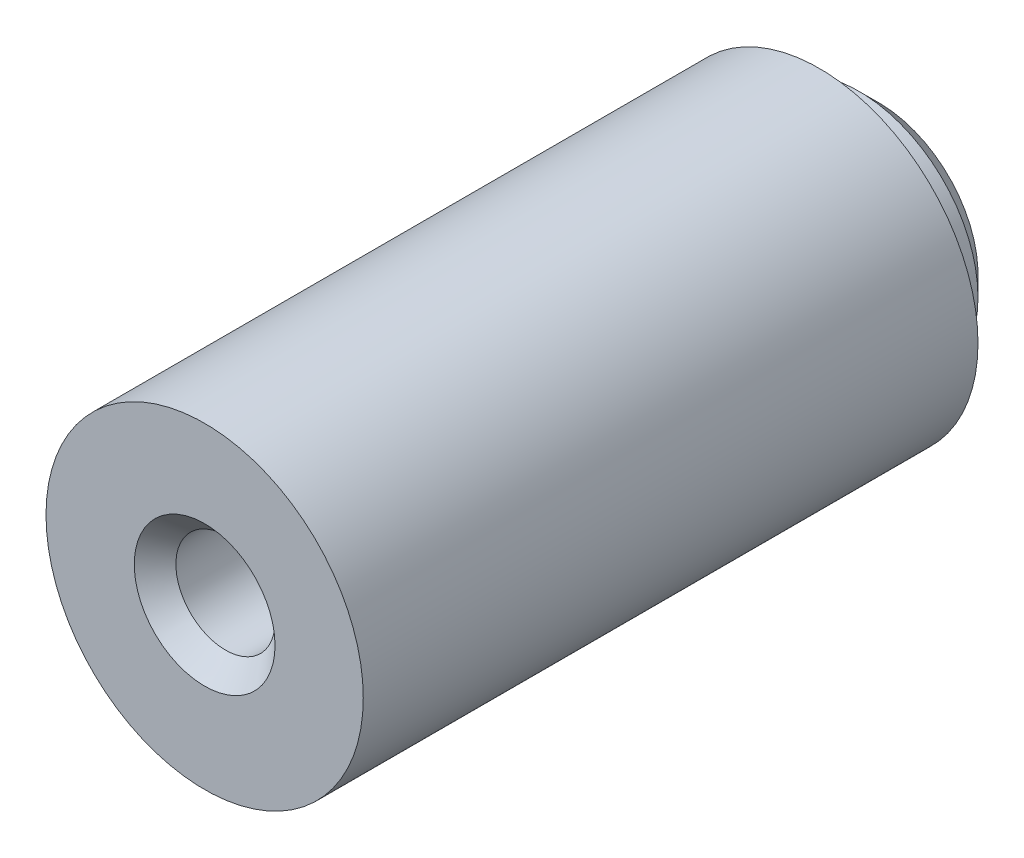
ISO-10303-21;
HEADER;
FILE_DESCRIPTION(('STEP AP214'),'2;1');
FILE_NAME('part.step','',(''),(''),'','','');
FILE_SCHEMA(('AUTOMOTIVE_DESIGN { 1 0 10303 214 1 1 1 1 }'));
ENDSEC;
DATA;
#1=APPLICATION_CONTEXT('core data for automotive mechanical design processes');
#2=APPLICATION_PROTOCOL_DEFINITION('international standard','automotive_design',2000,#1);
#3=PRODUCT_CONTEXT('',#1,'mechanical');
#4=PRODUCT('Part','Part','',(#3));
#5=PRODUCT_RELATED_PRODUCT_CATEGORY('part','',(#4));
#6=PRODUCT_DEFINITION_FORMATION('','',#4);
#7=PRODUCT_DEFINITION_CONTEXT('part definition',#1,'design');
#8=PRODUCT_DEFINITION('design','',#6,#7);
#9=PRODUCT_DEFINITION_SHAPE('','',#8);
#10=(LENGTH_UNIT() NAMED_UNIT(*) SI_UNIT(.MILLI.,.METRE.));
#11=(NAMED_UNIT(*) PLANE_ANGLE_UNIT() SI_UNIT($,.RADIAN.));
#12=(NAMED_UNIT(*) SI_UNIT($,.STERADIAN.) SOLID_ANGLE_UNIT());
#13=UNCERTAINTY_MEASURE_WITH_UNIT(LENGTH_MEASURE(1.E-05),#10,'distance_accuracy_value','');
#14=(GEOMETRIC_REPRESENTATION_CONTEXT(3) GLOBAL_UNCERTAINTY_ASSIGNED_CONTEXT((#13)) GLOBAL_UNIT_ASSIGNED_CONTEXT((#10,
#11,#12)) REPRESENTATION_CONTEXT('',''));
#15=CARTESIAN_POINT('',(0.,0.,0.));
#16=DIRECTION('',(0.,0.,1.));
#17=DIRECTION('',(1.,0.,0.));
#18=AXIS2_PLACEMENT_3D('',#15,#16,#17);
#19=CARTESIAN_POINT('',(0.,0.,0.));
#20=DIRECTION('',(0.,0.,1.));
#21=DIRECTION('',(1.,0.,0.));
#22=AXIS2_PLACEMENT_3D('',#19,#20,#21);
#23=PLANE('',#22);
#24=CARTESIAN_POINT('',(0.,0.,0.));
#25=DIRECTION('',(0.,0.,1.));
#26=DIRECTION('',(1.,0.,0.));
#27=AXIS2_PLACEMENT_3D('',#24,#25,#26);
#28=CIRCLE('',#27,4.);
#29=CARTESIAN_POINT('',(4.,0.,0.));
#30=VERTEX_POINT('',#29);
#31=EDGE_CURVE('E58',#30,#30,#28,.T.);
#32=ORIENTED_EDGE('',*,*,#31,.F.);
#33=EDGE_LOOP('',(#32));
#34=FACE_BOUND('',#33,.T.);
#35=CARTESIAN_POINT('',(0.,0.,0.));
#36=DIRECTION('',(0.,0.,1.));
#37=DIRECTION('',(1.,0.,0.));
#38=AXIS2_PLACEMENT_3D('',#35,#36,#37);
#39=CIRCLE('',#38,3.);
#40=CARTESIAN_POINT('',(3.,0.,0.));
#41=VERTEX_POINT('',#40);
#42=EDGE_CURVE('E70',#41,#41,#39,.F.);
#43=ORIENTED_EDGE('',*,*,#42,.F.);
#44=EDGE_LOOP('',(#43));
#45=FACE_BOUND('',#44,.T.);
#46=ADVANCED_FACE('F38',(#34,#45),#23,.F.);
#47=CARTESIAN_POINT('',(0.,0.,15.5));
#48=DIRECTION('',(0.,0.,-1.));
#49=DIRECTION('',(-1.,0.,0.));
#50=AXIS2_PLACEMENT_3D('',#47,#48,#49);
#51=CYLINDRICAL_SURFACE('',#50,4.);
#52=CARTESIAN_POINT('',(0.,0.,15.5));
#53=DIRECTION('',(0.,0.,1.));
#54=DIRECTION('',(1.,0.,0.));
#55=AXIS2_PLACEMENT_3D('',#52,#53,#54);
#56=CIRCLE('',#55,4.);
#57=CARTESIAN_POINT('',(4.,0.,15.5));
#58=VERTEX_POINT('',#57);
#59=EDGE_CURVE('E62',#58,#58,#56,.T.);
#60=ORIENTED_EDGE('',*,*,#59,.F.);
#61=EDGE_LOOP('',(#60));
#62=FACE_BOUND('',#61,.T.);
#63=ORIENTED_EDGE('',*,*,#31,.T.);
#64=EDGE_LOOP('',(#63));
#65=FACE_BOUND('',#64,.T.);
#66=ADVANCED_FACE('F87',(#62,#65),#51,.T.);
#67=CARTESIAN_POINT('',(0.,0.,15.5));
#68=DIRECTION('',(0.,0.,1.));
#69=DIRECTION('',(1.,0.,0.));
#70=AXIS2_PLACEMENT_3D('',#67,#68,#69);
#71=PLANE('',#70);
#72=CARTESIAN_POINT('',(0.000299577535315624,0.0346153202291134,15.5));
#73=DIRECTION('',(0.,0.,1.));
#74=DIRECTION('',(1.,0.,0.));
#75=AXIS2_PLACEMENT_3D('',#72,#73,#74);
#76=CIRCLE('',#75,1.775);
#77=CARTESIAN_POINT('',(1.77529957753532,0.0346153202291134,15.5));
#78=VERTEX_POINT('',#77);
#79=EDGE_CURVE('E65',#78,#78,#76,.T.);
#80=ORIENTED_EDGE('',*,*,#79,.F.);
#81=EDGE_LOOP('',(#80));
#82=FACE_BOUND('',#81,.T.);
#83=ORIENTED_EDGE('',*,*,#59,.T.);
#84=EDGE_LOOP('',(#83));
#85=FACE_BOUND('',#84,.T.);
#86=ADVANCED_FACE('F52',(#82,#85),#71,.T.);
#87=CARTESIAN_POINT('',(0.000299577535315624,0.0346153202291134,3.));
#88=DIRECTION('',(0.,0.,1.));
#89=DIRECTION('',(1.,0.,0.));
#90=AXIS2_PLACEMENT_3D('',#87,#88,#89);
#91=CONICAL_SURFACE('',#90,1.25,1.02974425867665);
#92=CARTESIAN_POINT('',(0.000299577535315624,0.0346153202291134,2.24892422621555));
#93=VERTEX_POINT('',#92);
#94=VERTEX_LOOP('',#93);
#95=FACE_BOUND('',#94,.T.);
#96=CARTESIAN_POINT('',(0.000299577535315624,0.0346153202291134,3.));
#97=DIRECTION('',(0.,0.,1.));
#98=DIRECTION('',(1.,0.,0.));
#99=AXIS2_PLACEMENT_3D('',#96,#97,#98);
#100=CIRCLE('',#99,1.25);
#101=CARTESIAN_POINT('',(1.25029957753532,0.0346153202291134,3.));
#102=VERTEX_POINT('',#101);
#103=EDGE_CURVE('E56',#102,#102,#100,.T.);
#104=ORIENTED_EDGE('',*,*,#103,.T.);
#105=EDGE_LOOP('',(#104));
#106=FACE_BOUND('',#105,.T.);
#107=ADVANCED_FACE('F48',(#95,#106),#91,.F.);
#108=CARTESIAN_POINT('',(0.000299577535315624,0.0346153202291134,15.5));
#109=DIRECTION('',(0.,0.,1.));
#110=DIRECTION('',(1.,0.,0.));
#111=AXIS2_PLACEMENT_3D('',#108,#109,#110);
#112=CYLINDRICAL_SURFACE('',#111,1.25);
#113=ORIENTED_EDGE('',*,*,#103,.F.);
#114=EDGE_LOOP('',(#113));
#115=FACE_BOUND('',#114,.T.);
#116=CARTESIAN_POINT('',(0.000299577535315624,0.0346153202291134,14.9750000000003));
#117=DIRECTION('',(0.,0.,1.));
#118=DIRECTION('',(1.,0.,0.));
#119=AXIS2_PLACEMENT_3D('',#116,#117,#118);
#120=CIRCLE('',#119,1.25);
#121=CARTESIAN_POINT('',(1.25029957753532,0.0346153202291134,14.9750000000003));
#122=VERTEX_POINT('',#121);
#123=EDGE_CURVE('E59',#122,#122,#120,.T.);
#124=ORIENTED_EDGE('',*,*,#123,.T.);
#125=EDGE_LOOP('',(#124));
#126=FACE_BOUND('',#125,.T.);
#127=ADVANCED_FACE('F51',(#115,#126),#112,.F.);
#128=CARTESIAN_POINT('',(0.000299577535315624,0.0346153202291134,15.5));
#129=DIRECTION('',(0.,0.,1.));
#130=DIRECTION('',(1.,0.,0.));
#131=AXIS2_PLACEMENT_3D('',#128,#129,#130);
#132=CONICAL_SURFACE('',#131,1.775,0.785398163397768);
#133=ORIENTED_EDGE('',*,*,#123,.F.);
#134=EDGE_LOOP('',(#133));
#135=FACE_BOUND('',#134,.T.);
#136=ORIENTED_EDGE('',*,*,#79,.T.);
#137=EDGE_LOOP('',(#136));
#138=FACE_BOUND('',#137,.T.);
#139=ADVANCED_FACE('F102',(#135,#138),#132,.F.);
#140=CARTESIAN_POINT('',(0.,0.,-1.5));
#141=DIRECTION('',(0.,0.,1.));
#142=DIRECTION('',(1.,0.,0.));
#143=AXIS2_PLACEMENT_3D('',#140,#141,#142);
#144=CYLINDRICAL_SURFACE('',#143,3.);
#145=CARTESIAN_POINT('',(0.,0.,-1.));
#146=DIRECTION('',(0.,0.,-1.));
#147=DIRECTION('',(-1.,0.,0.));
#148=AXIS2_PLACEMENT_3D('',#145,#146,#147);
#149=CIRCLE('',#148,3.);
#150=CARTESIAN_POINT('',(-3.,0.,-1.));
#151=VERTEX_POINT('',#150);
#152=EDGE_CURVE('E11',#151,#151,#149,.F.);
#153=ORIENTED_EDGE('',*,*,#152,.T.);
#154=EDGE_LOOP('',(#153));
#155=FACE_BOUND('',#154,.T.);
#156=ORIENTED_EDGE('',*,*,#42,.T.);
#157=EDGE_LOOP('',(#156));
#158=FACE_BOUND('',#157,.T.);
#159=ADVANCED_FACE('F83',(#155,#158),#144,.T.);
#160=CARTESIAN_POINT('',(0.,0.,-1.5));
#161=DIRECTION('',(0.,0.,-1.));
#162=DIRECTION('',(-1.,0.,0.));
#163=AXIS2_PLACEMENT_3D('',#160,#161,#162);
#164=PLANE('',#163);
#165=CARTESIAN_POINT('',(0.,0.,-1.5));
#166=DIRECTION('',(0.,0.,-1.));
#167=DIRECTION('',(-1.,0.,0.));
#168=AXIS2_PLACEMENT_3D('',#165,#166,#167);
#169=CIRCLE('',#168,2.5);
#170=CARTESIAN_POINT('',(-2.5,0.,-1.5));
#171=VERTEX_POINT('',#170);
#172=EDGE_CURVE('E45',#171,#171,#169,.T.);
#173=ORIENTED_EDGE('',*,*,#172,.T.);
#174=EDGE_LOOP('',(#173));
#175=FACE_BOUND('',#174,.T.);
#176=ADVANCED_FACE('F76',(#175),#164,.T.);
#177=CARTESIAN_POINT('',(0.,0.,-1.5));
#178=DIRECTION('',(0.,0.,1.));
#179=DIRECTION('',(1.,0.,0.));
#180=AXIS2_PLACEMENT_3D('',#177,#178,#179);
#181=CONICAL_SURFACE('',#180,2.5,0.78539816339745);
#182=ORIENTED_EDGE('',*,*,#152,.F.);
#183=EDGE_LOOP('',(#182));
#184=FACE_BOUND('',#183,.T.);
#185=ORIENTED_EDGE('',*,*,#172,.F.);
#186=EDGE_LOOP('',(#185));
#187=FACE_BOUND('',#186,.T.);
#188=ADVANCED_FACE('F40',(#184,#187),#181,.T.);
#189=CLOSED_SHELL('',(#46,#66,#86,#107,#127,#139,#159,#176,#188));
#190=MANIFOLD_SOLID_BREP('B2',#189);
#191=ADVANCED_BREP_SHAPE_REPRESENTATION('',(#18,#190),#14);
#192=SHAPE_DEFINITION_REPRESENTATION(#9,#191);
ENDSEC;
END-ISO-10303-21;
